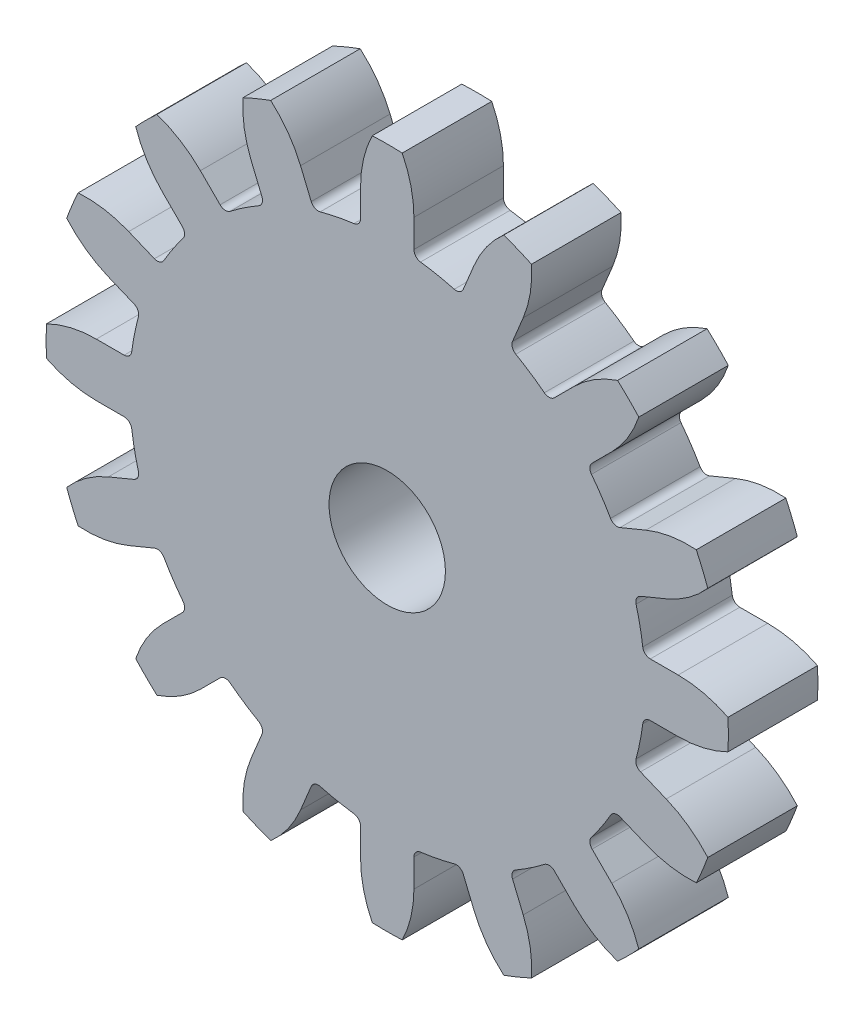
from build123d import *

# Parameters (mm, degrees)
SKETCH_7_R      = 6.5
EXTRUDE_2_DEPTH = 10


with BuildPart() as part:
    # Sketch 7 → Extrude 2 (new body)
    with BuildSketch(Plane.XY):
        with BuildLine():
            Line((-2.98, 32.496420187), (-2.98, 29.385822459))
            ThreePointArc((-2.98, 29.385822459), (-3.191124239, 28.825439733), (-3.719527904, 28.543674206))
            ThreePointArc((-3.719527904, 28.543674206), (-5.615674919, 28.231904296), (-7.486795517, 27.794318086))
            ThreePointArc((-7.486795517, 27.794318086), (-8.082803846, 27.852424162), (-8.492306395, 28.289356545))
            Line((-8.492306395, 28.289356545), (-9.68268061, 31.16317412))
            ThreePointArc((-9.68268061, 31.16317412), (-11.082694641, 33.677916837), (-13.02038399, 35.806139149))
            ThreePointArc((-13.02038399, 35.806139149), (-14.580238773, 35.199810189), (-16.111961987, 34.525565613))
            ThreePointArc((-16.111961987, 34.525565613), (-15.977234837, 31.650531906), (-15.189002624, 28.882380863))
            Line((-15.189002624, 28.882380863), (-13.998628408, 26.008563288))
            ThreePointArc((-13.998628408, 26.008563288), (-13.979232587, 25.410043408), (-14.359586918, 24.947514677))
            ThreePointArc((-14.359586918, 24.947514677), (-15.992089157, 23.93385279), (-17.553322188, 22.813528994))
            ThreePointArc((-17.553322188, 22.813528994), (-18.126198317, 22.639129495), (-18.671736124, 22.88609254))
            Line((-18.671736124, 22.88609254), (-20.871260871, 25.085617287))
            ThreePointArc((-20.871260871, 25.085617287), (-23.127055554, 26.873174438), (-25.731682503, 28.097873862))
            ThreePointArc((-25.731682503, 28.097873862), (-26.940768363, 26.940768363), (-28.097873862, 25.731682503))
            ThreePointArc((-28.097873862, 25.731682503), (-26.873174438, 23.127055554), (-25.085617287, 20.871260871))
            Line((-25.085617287, 20.871260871), (-22.88609254, 18.671736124))
            ThreePointArc((-22.88609254, 18.671736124), (-22.639129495, 18.126198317), (-22.813528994, 17.553322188))
            ThreePointArc((-22.813528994, 17.553322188), (-23.93385279, 15.992089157), (-24.947514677, 14.359586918))
            ThreePointArc((-24.947514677, 14.359586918), (-25.410043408, 13.979232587), (-26.008563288, 13.998628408))
            Line((-26.008563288, 13.998628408), (-28.882380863, 15.189002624))
            ThreePointArc((-28.882380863, 15.189002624), (-31.650531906, 15.977234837), (-34.525565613, 16.111961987))
            ThreePointArc((-34.525565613, 16.111961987), (-35.199810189, 14.580238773), (-35.806139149, 13.02038399))
            ThreePointArc((-35.806139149, 13.02038399), (-33.677916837, 11.082694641), (-31.16317412, 9.68268061))
            Line((-31.16317412, 9.68268061), (-28.289356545, 8.492306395))
            ThreePointArc((-28.289356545, 8.492306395), (-27.852424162, 8.082803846), (-27.794318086, 7.486795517))
            ThreePointArc((-27.794318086, 7.486795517), (-28.231904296, 5.615674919), (-28.543674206, 3.719527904))
            ThreePointArc((-28.543674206, 3.719527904), (-28.825439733, 3.191124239), (-29.385822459, 2.98))
            Line((-29.385822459, 2.98), (-32.496420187, 2.98))
            ThreePointArc((-32.496420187, 2.98), (-35.355501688, 2.648906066), (-38.063244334, 1.673149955))
            ThreePointArc((-38.063244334, 1.673149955), (-38.1, 0), (-38.063244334, -1.673149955))
            ThreePointArc((-38.063244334, -1.673149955), (-35.355501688, -2.648906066), (-32.496420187, -2.98))
            Line((-32.496420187, -2.98), (-29.385822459, -2.98))
            ThreePointArc((-29.385822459, -2.98), (-28.825439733, -3.191124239), (-28.543674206, -3.719527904))
            ThreePointArc((-28.543674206, -3.719527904), (-28.231904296, -5.615674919), (-27.794318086, -7.486795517))
            ThreePointArc((-27.794318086, -7.486795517), (-27.852424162, -8.082803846), (-28.289356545, -8.492306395))
            Line((-28.289356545, -8.492306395), (-31.16317412, -9.68268061))
            ThreePointArc((-31.16317412, -9.68268061), (-33.677916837, -11.082694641), (-35.806139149, -13.02038399))
            ThreePointArc((-35.806139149, -13.02038399), (-35.199810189, -14.580238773), (-34.525565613, -16.111961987))
            ThreePointArc((-34.525565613, -16.111961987), (-31.650531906, -15.977234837), (-28.882380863, -15.189002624))
            Line((-28.882380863, -15.189002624), (-26.008563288, -13.998628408))
            ThreePointArc((-26.008563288, -13.998628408), (-25.410043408, -13.979232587), (-24.947514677, -14.359586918))
            ThreePointArc((-24.947514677, -14.359586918), (-23.93385279, -15.992089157), (-22.813528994, -17.553322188))
            ThreePointArc((-22.813528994, -17.553322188), (-22.639129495, -18.126198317), (-22.88609254, -18.671736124))
            Line((-22.88609254, -18.671736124), (-25.085617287, -20.871260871))
            ThreePointArc((-25.085617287, -20.871260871), (-26.873174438, -23.127055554), (-28.097873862, -25.731682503))
            ThreePointArc((-28.097873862, -25.731682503), (-26.940768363, -26.940768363), (-25.731682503, -28.097873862))
            ThreePointArc((-25.731682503, -28.097873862), (-23.127055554, -26.873174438), (-20.871260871, -25.085617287))
            Line((-20.871260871, -25.085617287), (-18.671736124, -22.88609254))
            ThreePointArc((-18.671736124, -22.88609254), (-18.126198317, -22.639129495), (-17.553322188, -22.813528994))
            ThreePointArc((-17.553322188, -22.813528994), (-15.992089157, -23.93385279), (-14.359586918, -24.947514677))
            ThreePointArc((-14.359586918, -24.947514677), (-13.979232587, -25.410043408), (-13.998628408, -26.008563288))
            Line((-13.998628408, -26.008563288), (-15.189002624, -28.882380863))
            ThreePointArc((-15.189002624, -28.882380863), (-15.977234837, -31.650531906), (-16.111961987, -34.525565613))
            ThreePointArc((-16.111961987, -34.525565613), (-14.580238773, -35.199810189), (-13.02038399, -35.806139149))
            ThreePointArc((-13.02038399, -35.806139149), (-11.082694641, -33.677916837), (-9.68268061, -31.16317412))
            Line((-9.68268061, -31.16317412), (-8.492306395, -28.289356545))
            ThreePointArc((-8.492306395, -28.289356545), (-8.082803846, -27.852424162), (-7.486795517, -27.794318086))
            ThreePointArc((-7.486795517, -27.794318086), (-5.615674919, -28.231904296), (-3.719527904, -28.543674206))
            ThreePointArc((-3.719527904, -28.543674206), (-3.191124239, -28.825439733), (-2.98, -29.385822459))
            Line((-2.98, -29.385822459), (-2.98, -32.496420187))
            ThreePointArc((-2.98, -32.496420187), (-2.648906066, -35.355501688), (-1.673149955, -38.063244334))
            ThreePointArc((-1.673149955, -38.063244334), (0, -38.1), (1.673149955, -38.063244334))
            ThreePointArc((1.673149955, -38.063244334), (2.648906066, -35.355501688), (2.98, -32.496420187))
            Line((2.98, -32.496420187), (2.98, -29.385822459))
            ThreePointArc((2.98, -29.385822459), (3.191124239, -28.825439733), (3.719527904, -28.543674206))
            ThreePointArc((3.719527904, -28.543674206), (5.615674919, -28.231904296), (7.486795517, -27.794318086))
            ThreePointArc((7.486795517, -27.794318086), (8.082803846, -27.852424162), (8.492306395, -28.289356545))
            Line((8.492306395, -28.289356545), (9.68268061, -31.16317412))
            ThreePointArc((9.68268061, -31.16317412), (11.082694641, -33.677916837), (13.02038399, -35.806139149))
            ThreePointArc((13.02038399, -35.806139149), (14.580238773, -35.199810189), (16.111961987, -34.525565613))
            ThreePointArc((16.111961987, -34.525565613), (15.977234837, -31.650531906), (15.189002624, -28.882380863))
            Line((15.189002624, -28.882380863), (13.998628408, -26.008563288))
            ThreePointArc((13.998628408, -26.008563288), (13.979232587, -25.410043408), (14.359586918, -24.947514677))
            ThreePointArc((14.359586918, -24.947514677), (15.992089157, -23.93385279), (17.553322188, -22.813528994))
            ThreePointArc((17.553322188, -22.813528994), (18.126198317, -22.639129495), (18.671736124, -22.88609254))
            Line((18.671736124, -22.88609254), (20.871260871, -25.085617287))
            ThreePointArc((20.871260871, -25.085617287), (23.127055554, -26.873174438), (25.731682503, -28.097873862))
            ThreePointArc((25.731682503, -28.097873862), (26.940768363, -26.940768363), (28.097873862, -25.731682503))
            ThreePointArc((28.097873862, -25.731682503), (26.873174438, -23.127055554), (25.085617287, -20.871260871))
            Line((25.085617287, -20.871260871), (22.88609254, -18.671736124))
            ThreePointArc((22.88609254, -18.671736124), (22.639129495, -18.126198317), (22.813528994, -17.553322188))
            ThreePointArc((22.813528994, -17.553322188), (23.93385279, -15.992089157), (24.947514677, -14.359586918))
            ThreePointArc((24.947514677, -14.359586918), (25.410043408, -13.979232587), (26.008563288, -13.998628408))
            Line((26.008563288, -13.998628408), (28.882380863, -15.189002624))
            ThreePointArc((28.882380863, -15.189002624), (31.650531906, -15.977234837), (34.525565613, -16.111961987))
            ThreePointArc((34.525565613, -16.111961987), (35.199810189, -14.580238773), (35.806139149, -13.02038399))
            ThreePointArc((35.806139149, -13.02038399), (33.677916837, -11.082694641), (31.16317412, -9.68268061))
            Line((31.16317412, -9.68268061), (28.289356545, -8.492306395))
            ThreePointArc((28.289356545, -8.492306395), (27.852424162, -8.082803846), (27.794318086, -7.486795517))
            ThreePointArc((27.794318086, -7.486795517), (28.231904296, -5.615674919), (28.543674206, -3.719527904))
            ThreePointArc((28.543674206, -3.719527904), (28.825439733, -3.191124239), (29.385822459, -2.98))
            Line((29.385822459, -2.98), (32.496420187, -2.98))
            ThreePointArc((32.496420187, -2.98), (35.355501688, -2.648906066), (38.063244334, -1.673149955))
            ThreePointArc((38.063244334, -1.673149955), (38.1, 0), (38.063244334, 1.673149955))
            ThreePointArc((38.063244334, 1.673149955), (35.355501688, 2.648906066), (32.496420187, 2.98))
            Line((32.496420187, 2.98), (29.385822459, 2.98))
            ThreePointArc((29.385822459, 2.98), (28.825439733, 3.191124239), (28.543674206, 3.719527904))
            ThreePointArc((28.543674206, 3.719527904), (28.231904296, 5.615674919), (27.794318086, 7.486795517))
            ThreePointArc((27.794318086, 7.486795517), (27.852424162, 8.082803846), (28.289356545, 8.492306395))
            Line((28.289356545, 8.492306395), (31.16317412, 9.68268061))
            ThreePointArc((31.16317412, 9.68268061), (33.677916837, 11.082694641), (35.806139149, 13.02038399))
            ThreePointArc((35.806139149, 13.02038399), (35.199810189, 14.580238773), (34.525565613, 16.111961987))
            ThreePointArc((34.525565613, 16.111961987), (31.650531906, 15.977234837), (28.882380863, 15.189002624))
            Line((28.882380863, 15.189002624), (26.008563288, 13.998628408))
            ThreePointArc((26.008563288, 13.998628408), (25.410043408, 13.979232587), (24.947514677, 14.359586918))
            ThreePointArc((24.947514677, 14.359586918), (23.93385279, 15.992089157), (22.813528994, 17.553322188))
            ThreePointArc((22.813528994, 17.553322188), (22.639129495, 18.126198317), (22.88609254, 18.671736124))
            Line((22.88609254, 18.671736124), (25.085617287, 20.871260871))
            ThreePointArc((25.085617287, 20.871260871), (26.873174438, 23.127055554), (28.097873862, 25.731682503))
            ThreePointArc((28.097873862, 25.731682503), (26.940768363, 26.940768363), (25.731682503, 28.097873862))
            ThreePointArc((25.731682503, 28.097873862), (23.127055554, 26.873174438), (20.871260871, 25.085617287))
            Line((20.871260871, 25.085617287), (18.671736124, 22.88609254))
            ThreePointArc((18.671736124, 22.88609254), (18.126198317, 22.639129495), (17.553322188, 22.813528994))
            ThreePointArc((17.553322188, 22.813528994), (15.992089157, 23.93385279), (14.359586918, 24.947514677))
            ThreePointArc((14.359586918, 24.947514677), (13.979232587, 25.410043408), (13.998628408, 26.008563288))
            Line((13.998628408, 26.008563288), (15.189002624, 28.882380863))
            ThreePointArc((15.189002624, 28.882380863), (15.977234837, 31.650531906), (16.111961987, 34.525565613))
            ThreePointArc((16.111961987, 34.525565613), (14.580238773, 35.199810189), (13.02038399, 35.806139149))
            ThreePointArc((13.02038399, 35.806139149), (11.082694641, 33.677916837), (9.68268061, 31.16317412))
            Line((9.68268061, 31.16317412), (8.492306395, 28.289356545))
            ThreePointArc((8.492306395, 28.289356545), (8.082803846, 27.852424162), (7.486795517, 27.794318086))
            ThreePointArc((7.486795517, 27.794318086), (5.615674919, 28.231904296), (3.719527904, 28.543674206))
            ThreePointArc((3.719527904, 28.543674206), (3.191124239, 28.825439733), (2.98, 29.385822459))
            Line((2.98, 29.385822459), (2.98, 32.496420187))
            ThreePointArc((2.98, 32.496420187), (2.648906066, 35.355501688), (1.673149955, 38.063244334))
            ThreePointArc((1.673149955, 38.063244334), (0, 38.1), (-1.673149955, 38.063244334))
            ThreePointArc((-1.673149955, 38.063244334), (-2.648906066, 35.355501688), (-2.98, 32.496420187))
        make_face()
        Circle(SKETCH_7_R, mode=Mode.SUBTRACT)
    extrude(amount=EXTRUDE_2_DEPTH)


solid = part.part
